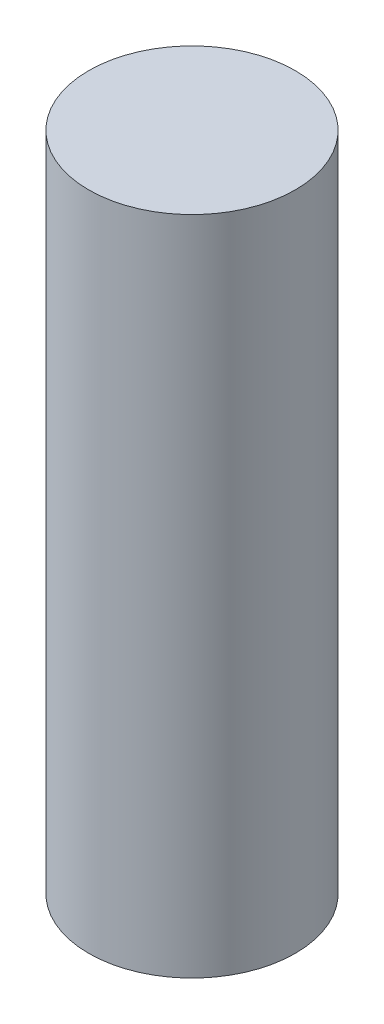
ISO-10303-21;
HEADER;
FILE_DESCRIPTION(('STEP AP214'),'2;1');
FILE_NAME('part.step','',(''),(''),'','','');
FILE_SCHEMA(('AUTOMOTIVE_DESIGN { 1 0 10303 214 1 1 1 1 }'));
ENDSEC;
DATA;
#1=APPLICATION_CONTEXT('core data for automotive mechanical design processes');
#2=APPLICATION_PROTOCOL_DEFINITION('international standard','automotive_design',2000,#1);
#3=PRODUCT_CONTEXT('',#1,'mechanical');
#4=PRODUCT('Part','Part','',(#3));
#5=PRODUCT_RELATED_PRODUCT_CATEGORY('part','',(#4));
#6=PRODUCT_DEFINITION_FORMATION('','',#4);
#7=PRODUCT_DEFINITION_CONTEXT('part definition',#1,'design');
#8=PRODUCT_DEFINITION('design','',#6,#7);
#9=PRODUCT_DEFINITION_SHAPE('','',#8);
#10=(LENGTH_UNIT() NAMED_UNIT(*) SI_UNIT(.MILLI.,.METRE.));
#11=(NAMED_UNIT(*) PLANE_ANGLE_UNIT() SI_UNIT($,.RADIAN.));
#12=(NAMED_UNIT(*) SI_UNIT($,.STERADIAN.) SOLID_ANGLE_UNIT());
#13=UNCERTAINTY_MEASURE_WITH_UNIT(LENGTH_MEASURE(1.E-05),#10,'distance_accuracy_value','');
#14=(GEOMETRIC_REPRESENTATION_CONTEXT(3) GLOBAL_UNCERTAINTY_ASSIGNED_CONTEXT((#13)) GLOBAL_UNIT_ASSIGNED_CONTEXT((#10,
#11,#12)) REPRESENTATION_CONTEXT('',''));
#15=CARTESIAN_POINT('',(0.,0.,0.));
#16=DIRECTION('',(0.,0.,1.));
#17=DIRECTION('',(1.,0.,0.));
#18=AXIS2_PLACEMENT_3D('',#15,#16,#17);
#19=CARTESIAN_POINT('',(0.,320.,0.));
#20=DIRECTION('',(0.,-1.,0.));
#21=DIRECTION('',(0.,0.,-1.));
#22=AXIS2_PLACEMENT_3D('',#19,#20,#21);
#23=CYLINDRICAL_SURFACE('',#22,50.);
#24=CARTESIAN_POINT('',(0.,320.,0.));
#25=DIRECTION('',(0.,1.,0.));
#26=DIRECTION('',(0.,0.,1.));
#27=AXIS2_PLACEMENT_3D('',#24,#25,#26);
#28=CIRCLE('',#27,50.);
#29=CARTESIAN_POINT('',(0.,320.,-50.));
#30=VERTEX_POINT('',#29);
#31=EDGE_CURVE('E10',#30,#30,#28,.T.);
#32=CARTESIAN_POINT('',(0.,0.,0.));
#33=DIRECTION('',(0.,1.,0.));
#34=DIRECTION('',(0.,0.,1.));
#35=AXIS2_PLACEMENT_3D('',#32,#33,#34);
#36=CIRCLE('',#35,50.);
#37=CARTESIAN_POINT('',(0.,0.,-50.));
#38=VERTEX_POINT('',#37);
#39=EDGE_CURVE('E32',#38,#38,#36,.T.);
#40=CARTESIAN_POINT('',(0.,320.,-50.));
#41=CARTESIAN_POINT('',(0.,316.666666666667,-50.));
#42=CARTESIAN_POINT('',(0.,313.333333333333,-50.));
#43=CARTESIAN_POINT('',(0.,306.666666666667,-50.));
#44=CARTESIAN_POINT('',(0.,303.333333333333,-50.));
#45=CARTESIAN_POINT('',(0.,296.666666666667,-50.));
#46=CARTESIAN_POINT('',(0.,293.333333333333,-50.));
#47=CARTESIAN_POINT('',(0.,286.666666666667,-50.));
#48=CARTESIAN_POINT('',(0.,283.333333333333,-50.));
#49=CARTESIAN_POINT('',(0.,276.666666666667,-50.));
#50=CARTESIAN_POINT('',(0.,273.333333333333,-50.));
#51=CARTESIAN_POINT('',(0.,266.666666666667,-50.));
#52=CARTESIAN_POINT('',(0.,263.333333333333,-50.));
#53=CARTESIAN_POINT('',(0.,256.666666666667,-50.));
#54=CARTESIAN_POINT('',(0.,253.333333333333,-50.));
#55=CARTESIAN_POINT('',(0.,246.666666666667,-50.));
#56=CARTESIAN_POINT('',(0.,243.333333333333,-50.));
#57=CARTESIAN_POINT('',(0.,236.666666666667,-50.));
#58=CARTESIAN_POINT('',(0.,233.333333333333,-50.));
#59=CARTESIAN_POINT('',(0.,226.666666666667,-50.));
#60=CARTESIAN_POINT('',(0.,223.333333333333,-50.));
#61=CARTESIAN_POINT('',(0.,216.666666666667,-50.));
#62=CARTESIAN_POINT('',(0.,213.333333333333,-50.));
#63=CARTESIAN_POINT('',(0.,206.666666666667,-50.));
#64=CARTESIAN_POINT('',(0.,203.333333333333,-50.));
#65=CARTESIAN_POINT('',(0.,196.666666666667,-50.));
#66=CARTESIAN_POINT('',(0.,193.333333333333,-50.));
#67=CARTESIAN_POINT('',(0.,186.666666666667,-50.));
#68=CARTESIAN_POINT('',(0.,183.333333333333,-50.));
#69=CARTESIAN_POINT('',(0.,176.666666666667,-50.));
#70=CARTESIAN_POINT('',(0.,173.333333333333,-50.));
#71=CARTESIAN_POINT('',(0.,166.666666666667,-50.));
#72=CARTESIAN_POINT('',(0.,163.333333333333,-50.));
#73=CARTESIAN_POINT('',(0.,156.666666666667,-50.));
#74=CARTESIAN_POINT('',(0.,153.333333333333,-50.));
#75=CARTESIAN_POINT('',(0.,146.666666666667,-50.));
#76=CARTESIAN_POINT('',(0.,143.333333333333,-50.));
#77=CARTESIAN_POINT('',(0.,136.666666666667,-50.));
#78=CARTESIAN_POINT('',(0.,133.333333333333,-50.));
#79=CARTESIAN_POINT('',(0.,126.666666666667,-50.));
#80=CARTESIAN_POINT('',(0.,123.333333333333,-50.));
#81=CARTESIAN_POINT('',(0.,116.666666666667,-50.));
#82=CARTESIAN_POINT('',(0.,113.333333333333,-50.));
#83=CARTESIAN_POINT('',(0.,106.666666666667,-50.));
#84=CARTESIAN_POINT('',(0.,103.333333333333,-50.));
#85=CARTESIAN_POINT('',(0.,96.6666666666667,-50.));
#86=CARTESIAN_POINT('',(0.,93.3333333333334,-50.));
#87=CARTESIAN_POINT('',(0.,86.6666666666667,-50.));
#88=CARTESIAN_POINT('',(0.,83.3333333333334,-50.));
#89=CARTESIAN_POINT('',(0.,76.6666666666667,-50.));
#90=CARTESIAN_POINT('',(0.,73.3333333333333,-50.));
#91=CARTESIAN_POINT('',(0.,66.6666666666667,-50.));
#92=CARTESIAN_POINT('',(0.,63.3333333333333,-50.));
#93=CARTESIAN_POINT('',(0.,56.6666666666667,-50.));
#94=CARTESIAN_POINT('',(0.,53.3333333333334,-50.));
#95=CARTESIAN_POINT('',(0.,46.6666666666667,-50.));
#96=CARTESIAN_POINT('',(0.,43.3333333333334,-50.));
#97=CARTESIAN_POINT('',(0.,36.6666666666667,-50.));
#98=CARTESIAN_POINT('',(0.,33.3333333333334,-50.));
#99=CARTESIAN_POINT('',(0.,26.6666666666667,-50.));
#100=CARTESIAN_POINT('',(0.,23.3333333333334,-50.));
#101=CARTESIAN_POINT('',(0.,16.6666666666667,-50.));
#102=CARTESIAN_POINT('',(0.,13.3333333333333,-50.));
#103=CARTESIAN_POINT('',(0.,6.66666666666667,-50.));
#104=CARTESIAN_POINT('',(0.,3.33333333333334,-50.));
#105=CARTESIAN_POINT('',(0.,0.,-50.));
#106=B_SPLINE_CURVE_WITH_KNOTS('',3,(#40,#41,#42,#43,#44,#45,#46,#47,#48,#49,#50,#51,#52,#53,
#54,#55,#56,#57,#58,#59,#60,#61,#62,#63,#64,#65,#66,#67,#68,#69,#70,#71,#72,#73,#74,#75,#76,#77,
#78,#79,#80,#81,#82,#83,#84,#85,#86,#87,#88,#89,#90,#91,#92,#93,#94,#95,#96,#97,#98,#99,#100,
#101,#102,#103,#104,#105),.UNSPECIFIED.,.F.,.F.,(4,2,2,2,2,2,2,2,2,2,2,2,2,2,2,2,2,2,2,2,2,2,2,
2,2,2,2,2,2,2,2,2,4),(0.,9.99999999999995,20.,30.,40.,50.,60.,70.,80.,90.,100.,110.,120.,130.,
140.,150.,160.,170.,180.,190.,200.,210.,220.,230.,240.,250.,260.,270.,280.,290.,300.,310.,320.),.UNSPECIFIED.);
#107=EDGE_CURVE('BSEAM29',#30,#38,#106,.T.);
#108=ORIENTED_EDGE('',*,*,#31,.F.);
#109=ORIENTED_EDGE('',*,*,#39,.T.);
#110=ORIENTED_EDGE('',*,*,#107,.T.);
#111=ORIENTED_EDGE('',*,*,#107,.F.);
#112=EDGE_LOOP('',(#108,#110,#109,#111));
#113=FACE_BOUND('',#112,.T.);
#114=ADVANCED_FACE('F29',(#113),#23,.T.);
#115=CARTESIAN_POINT('',(0.,320.,0.));
#116=DIRECTION('',(0.,1.,0.));
#117=DIRECTION('',(0.,0.,1.));
#118=AXIS2_PLACEMENT_3D('',#115,#116,#117);
#119=PLANE('',#118);
#120=ORIENTED_EDGE('',*,*,#31,.T.);
#121=EDGE_LOOP('',(#120));
#122=FACE_BOUND('',#121,.T.);
#123=ADVANCED_FACE('F44',(#122),#119,.T.);
#124=CARTESIAN_POINT('',(0.,0.,0.));
#125=DIRECTION('',(0.,1.,0.));
#126=DIRECTION('',(0.,0.,1.));
#127=AXIS2_PLACEMENT_3D('',#124,#125,#126);
#128=PLANE('',#127);
#129=ORIENTED_EDGE('',*,*,#39,.F.);
#130=EDGE_LOOP('',(#129));
#131=FACE_BOUND('',#130,.T.);
#132=ADVANCED_FACE('F42',(#131),#128,.F.);
#133=CLOSED_SHELL('',(#114,#123,#132));
#134=MANIFOLD_SOLID_BREP('B2',#133);
#135=ADVANCED_BREP_SHAPE_REPRESENTATION('',(#18,#134),#14);
#136=SHAPE_DEFINITION_REPRESENTATION(#9,#135);
ENDSEC;
END-ISO-10303-21;
